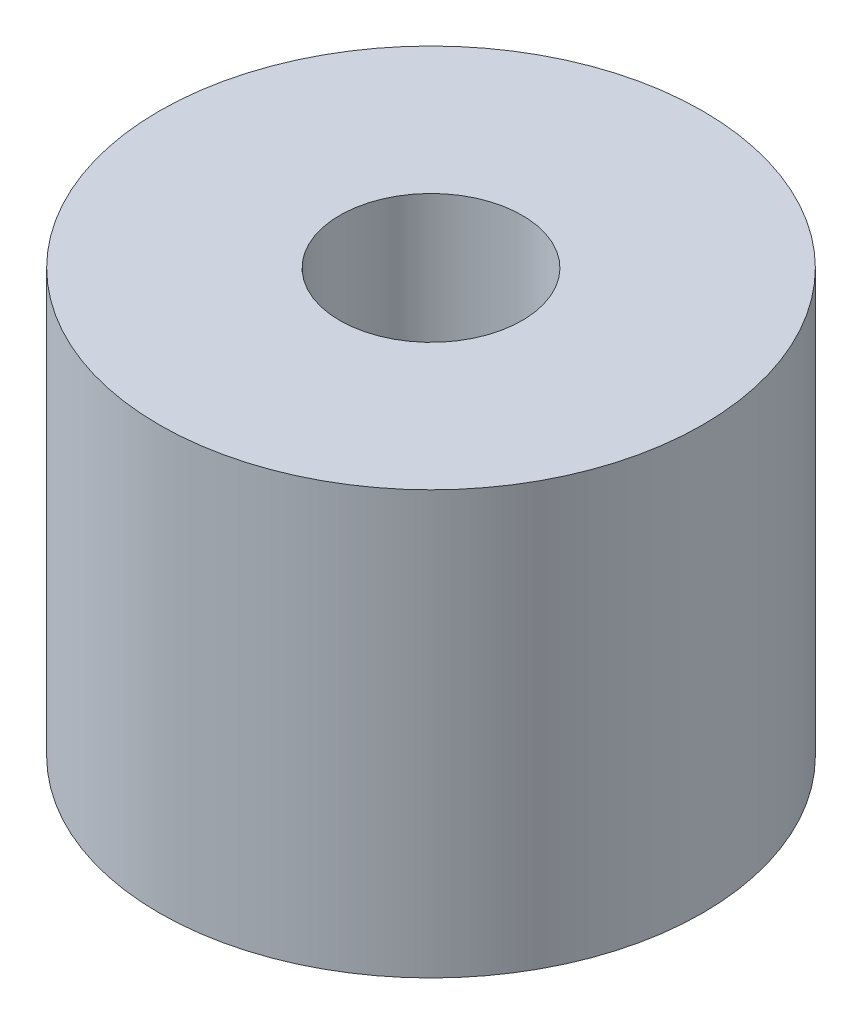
ISO-10303-21;
HEADER;
FILE_DESCRIPTION(('STEP AP214'),'2;1');
FILE_NAME('part.step','',(''),(''),'','','');
FILE_SCHEMA(('AUTOMOTIVE_DESIGN { 1 0 10303 214 1 1 1 1 }'));
ENDSEC;
DATA;
#1=APPLICATION_CONTEXT('core data for automotive mechanical design processes');
#2=APPLICATION_PROTOCOL_DEFINITION('international standard','automotive_design',2000,#1);
#3=PRODUCT_CONTEXT('',#1,'mechanical');
#4=PRODUCT('Part','Part','',(#3));
#5=PRODUCT_RELATED_PRODUCT_CATEGORY('part','',(#4));
#6=PRODUCT_DEFINITION_FORMATION('','',#4);
#7=PRODUCT_DEFINITION_CONTEXT('part definition',#1,'design');
#8=PRODUCT_DEFINITION('design','',#6,#7);
#9=PRODUCT_DEFINITION_SHAPE('','',#8);
#10=(LENGTH_UNIT() NAMED_UNIT(*) SI_UNIT(.MILLI.,.METRE.));
#11=(NAMED_UNIT(*) PLANE_ANGLE_UNIT() SI_UNIT($,.RADIAN.));
#12=(NAMED_UNIT(*) SI_UNIT($,.STERADIAN.) SOLID_ANGLE_UNIT());
#13=UNCERTAINTY_MEASURE_WITH_UNIT(LENGTH_MEASURE(1.E-05),#10,'distance_accuracy_value','');
#14=(GEOMETRIC_REPRESENTATION_CONTEXT(3) GLOBAL_UNCERTAINTY_ASSIGNED_CONTEXT((#13)) GLOBAL_UNIT_ASSIGNED_CONTEXT((#10,
#11,#12)) REPRESENTATION_CONTEXT('',''));
#15=CARTESIAN_POINT('',(0.,0.,0.));
#16=DIRECTION('',(0.,0.,1.));
#17=DIRECTION('',(1.,0.,0.));
#18=AXIS2_PLACEMENT_3D('',#15,#16,#17);
#19=CARTESIAN_POINT('',(0.,35.,0.));
#20=DIRECTION('',(0.,-1.,0.));
#21=DIRECTION('',(0.,0.,-1.));
#22=AXIS2_PLACEMENT_3D('',#19,#20,#21);
#23=CYLINDRICAL_SURFACE('',#22,22.5);
#24=CARTESIAN_POINT('',(0.,35.,0.));
#25=DIRECTION('',(0.,1.,0.));
#26=DIRECTION('',(0.,0.,1.));
#27=AXIS2_PLACEMENT_3D('',#24,#25,#26);
#28=CIRCLE('',#27,22.5);
#29=CARTESIAN_POINT('',(0.,35.,22.5));
#30=VERTEX_POINT('',#29);
#31=EDGE_CURVE('E10',#30,#30,#28,.T.);
#32=ORIENTED_EDGE('',*,*,#31,.F.);
#33=EDGE_LOOP('',(#32));
#34=FACE_BOUND('',#33,.T.);
#35=CARTESIAN_POINT('',(0.,0.,0.));
#36=DIRECTION('',(0.,1.,0.));
#37=DIRECTION('',(0.,0.,1.));
#38=AXIS2_PLACEMENT_3D('',#35,#36,#37);
#39=CIRCLE('',#38,22.5);
#40=CARTESIAN_POINT('',(0.,0.,22.5));
#41=VERTEX_POINT('',#40);
#42=EDGE_CURVE('E34',#41,#41,#39,.T.);
#43=ORIENTED_EDGE('',*,*,#42,.T.);
#44=EDGE_LOOP('',(#43));
#45=FACE_BOUND('',#44,.T.);
#46=ADVANCED_FACE('F31',(#34,#45),#23,.T.);
#47=CARTESIAN_POINT('',(0.,35.,0.));
#48=DIRECTION('',(0.,1.,0.));
#49=DIRECTION('',(0.,0.,1.));
#50=AXIS2_PLACEMENT_3D('',#47,#48,#49);
#51=PLANE('',#50);
#52=CARTESIAN_POINT('',(0.,35.,0.));
#53=DIRECTION('',(0.,1.,0.));
#54=DIRECTION('',(0.,0.,1.));
#55=AXIS2_PLACEMENT_3D('',#52,#53,#54);
#56=CIRCLE('',#55,7.55);
#57=CARTESIAN_POINT('',(0.,35.,7.55));
#58=VERTEX_POINT('',#57);
#59=EDGE_CURVE('E43',#58,#58,#56,.T.);
#60=ORIENTED_EDGE('',*,*,#59,.F.);
#61=EDGE_LOOP('',(#60));
#62=FACE_BOUND('',#61,.T.);
#63=ORIENTED_EDGE('',*,*,#31,.T.);
#64=EDGE_LOOP('',(#63));
#65=FACE_BOUND('',#64,.T.);
#66=ADVANCED_FACE('F77',(#62,#65),#51,.T.);
#67=CARTESIAN_POINT('',(0.,0.,0.));
#68=DIRECTION('',(0.,1.,0.));
#69=DIRECTION('',(0.,0.,1.));
#70=AXIS2_PLACEMENT_3D('',#67,#68,#69);
#71=PLANE('',#70);
#72=CARTESIAN_POINT('',(0.,0.,0.));
#73=DIRECTION('',(0.,1.,0.));
#74=DIRECTION('',(0.,0.,1.));
#75=AXIS2_PLACEMENT_3D('',#72,#73,#74);
#76=CIRCLE('',#75,3.3);
#77=CARTESIAN_POINT('',(0.,0.,3.3));
#78=VERTEX_POINT('',#77);
#79=EDGE_CURVE('E46',#78,#78,#76,.T.);
#80=ORIENTED_EDGE('',*,*,#79,.T.);
#81=EDGE_LOOP('',(#80));
#82=FACE_BOUND('',#81,.T.);
#83=ORIENTED_EDGE('',*,*,#42,.F.);
#84=EDGE_LOOP('',(#83));
#85=FACE_BOUND('',#84,.T.);
#86=ADVANCED_FACE('F73',(#82,#85),#71,.F.);
#87=CARTESIAN_POINT('',(0.,10.,0.));
#88=DIRECTION('',(0.,1.,0.));
#89=DIRECTION('',(0.,0.,1.));
#90=AXIS2_PLACEMENT_3D('',#87,#88,#89);
#91=CYLINDRICAL_SURFACE('',#90,7.55);
#92=CARTESIAN_POINT('',(0.,10.,0.));
#93=DIRECTION('',(0.,1.,0.));
#94=DIRECTION('',(0.,0.,1.));
#95=AXIS2_PLACEMENT_3D('',#92,#93,#94);
#96=CIRCLE('',#95,7.55);
#97=CARTESIAN_POINT('',(0.,10.,7.55));
#98=VERTEX_POINT('',#97);
#99=EDGE_CURVE('E41',#98,#98,#96,.T.);
#100=ORIENTED_EDGE('',*,*,#99,.F.);
#101=EDGE_LOOP('',(#100));
#102=FACE_BOUND('',#101,.T.);
#103=ORIENTED_EDGE('',*,*,#59,.T.);
#104=EDGE_LOOP('',(#103));
#105=FACE_BOUND('',#104,.T.);
#106=ADVANCED_FACE('F67',(#102,#105),#91,.F.);
#107=CARTESIAN_POINT('',(0.,10.,0.));
#108=DIRECTION('',(0.,1.,0.));
#109=DIRECTION('',(0.,0.,1.));
#110=AXIS2_PLACEMENT_3D('',#107,#108,#109);
#111=PLANE('',#110);
#112=CARTESIAN_POINT('',(0.,10.,0.));
#113=DIRECTION('',(0.,1.,0.));
#114=DIRECTION('',(0.,0.,1.));
#115=AXIS2_PLACEMENT_3D('',#112,#113,#114);
#116=CIRCLE('',#115,5.5);
#117=CARTESIAN_POINT('',(0.,10.,5.5));
#118=VERTEX_POINT('',#117);
#119=EDGE_CURVE('E57',#118,#118,#116,.T.);
#120=ORIENTED_EDGE('',*,*,#119,.F.);
#121=EDGE_LOOP('',(#120));
#122=FACE_BOUND('',#121,.T.);
#123=ORIENTED_EDGE('',*,*,#99,.T.);
#124=EDGE_LOOP('',(#123));
#125=FACE_BOUND('',#124,.T.);
#126=ADVANCED_FACE('F63',(#122,#125),#111,.T.);
#127=CARTESIAN_POINT('',(0.,10.,0.));
#128=DIRECTION('',(0.,1.,0.));
#129=DIRECTION('',(0.,0.,1.));
#130=AXIS2_PLACEMENT_3D('',#127,#128,#129);
#131=CYLINDRICAL_SURFACE('',#130,3.3);
#132=ORIENTED_EDGE('',*,*,#79,.F.);
#133=EDGE_LOOP('',(#132));
#134=FACE_BOUND('',#133,.T.);
#135=CARTESIAN_POINT('',(0.,3.,0.));
#136=DIRECTION('',(0.,1.,0.));
#137=DIRECTION('',(0.,0.,1.));
#138=AXIS2_PLACEMENT_3D('',#135,#136,#137);
#139=CIRCLE('',#138,3.3);
#140=CARTESIAN_POINT('',(0.,3.,3.3));
#141=VERTEX_POINT('',#140);
#142=EDGE_CURVE('E51',#141,#141,#139,.T.);
#143=ORIENTED_EDGE('',*,*,#142,.T.);
#144=EDGE_LOOP('',(#143));
#145=FACE_BOUND('',#144,.T.);
#146=ADVANCED_FACE('F66',(#134,#145),#131,.F.);
#147=CARTESIAN_POINT('',(3.3,3.,0.));
#148=DIRECTION('',(0.,-1.,0.));
#149=DIRECTION('',(0.,0.,-1.));
#150=AXIS2_PLACEMENT_3D('',#147,#148,#149);
#151=PLANE('',#150);
#152=ORIENTED_EDGE('',*,*,#142,.F.);
#153=EDGE_LOOP('',(#152));
#154=FACE_BOUND('',#153,.T.);
#155=CARTESIAN_POINT('',(0.,3.,0.));
#156=DIRECTION('',(0.,1.,0.));
#157=DIRECTION('',(0.,0.,1.));
#158=AXIS2_PLACEMENT_3D('',#155,#156,#157);
#159=CIRCLE('',#158,5.5);
#160=CARTESIAN_POINT('',(0.,3.,5.5));
#161=VERTEX_POINT('',#160);
#162=EDGE_CURVE('E54',#161,#161,#159,.T.);
#163=ORIENTED_EDGE('',*,*,#162,.T.);
#164=EDGE_LOOP('',(#163));
#165=FACE_BOUND('',#164,.T.);
#166=ADVANCED_FACE('F89',(#154,#165),#151,.F.);
#167=CARTESIAN_POINT('',(0.,10.,0.));
#168=DIRECTION('',(0.,1.,0.));
#169=DIRECTION('',(0.,0.,1.));
#170=AXIS2_PLACEMENT_3D('',#167,#168,#169);
#171=CYLINDRICAL_SURFACE('',#170,5.5);
#172=ORIENTED_EDGE('',*,*,#162,.F.);
#173=EDGE_LOOP('',(#172));
#174=FACE_BOUND('',#173,.T.);
#175=ORIENTED_EDGE('',*,*,#119,.T.);
#176=EDGE_LOOP('',(#175));
#177=FACE_BOUND('',#176,.T.);
#178=ADVANCED_FACE('F61',(#174,#177),#171,.F.);
#179=CLOSED_SHELL('',(#46,#66,#86,#106,#126,#146,#166,#178));
#180=MANIFOLD_SOLID_BREP('B2',#179);
#181=ADVANCED_BREP_SHAPE_REPRESENTATION('',(#18,#180),#14);
#182=SHAPE_DEFINITION_REPRESENTATION(#9,#181);
ENDSEC;
END-ISO-10303-21;
